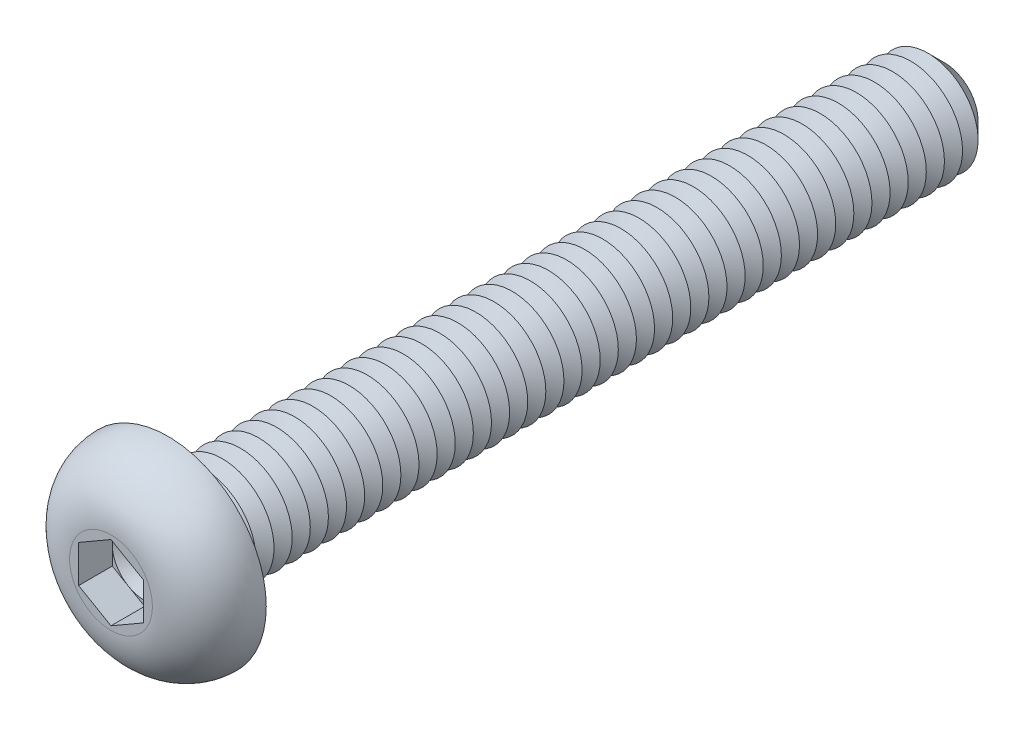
from build123d import *

# Parameters (mm, degrees)
CUT_EXTRUDE1_DEPTH  = 1.3
SKETCH4_R           = 2
BOSS_EXTRUDE1_DEPTH = 30
CHAMFER1_SIZE       = 0.7
LPATTERN1_COUNT     = 41
LPATTERN1_PITCH     = 0.7
FILLET2_R           = 0.3


with BuildPart() as part:
    # Sketch2 → Revolve1 (revolve)
    with BuildSketch(Plane(origin=(0, 0, 0), x_dir=(0, 0, -1), z_dir=(1, 0, 0)), mode=Mode.PRIVATE) as revolve1_sk:
        with BuildLine():
            Line((0, 0), (-2.2, 0))
            Line((-2.2, 0), (-2.2, 1.6))
            ThreePointArc((-2.2, 1.6), (-1.555634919, 3.155634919), (0, 3.8))
            Line((0, 3.8), (0, 0))
        make_face()
    revolve(revolve1_sk.sketch.rotate(Axis((0, 0, 47.934239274), (0, 0, -1)), 90), axis=Axis((0, 0, 47.934239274), (0, 0, -1)))

    # Sketch3 → Cut-Extrude1 (cut)
    with BuildSketch(Plane.XY.offset(2.2)):
        Polygon((0, 1.443375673), (-1.25, 0.721687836), (-1.25, -0.721687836), (0, -1.443375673), (1.25, -0.721687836), (1.25, 0.721687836), align=None)
    extrude(amount=-CUT_EXTRUDE1_DEPTH, mode=Mode.SUBTRACT)

    # Sketch4 → Boss-Extrude1 (add)
    with BuildSketch(Plane(origin=(0, 0, 0), x_dir=(-1, 0, 0), z_dir=(0, 0, -1))):
        with Locations(Location((0, 0, 0), (0, 0, 180))):
            Circle(SKETCH4_R)
    extrude(amount=BOSS_EXTRUDE1_DEPTH)

    # Chamfer1
    chamfer1_edges = [part.edges().sort_by_distance(p)[0] for p in [
        (-2, 0, -30),
    ]]
    chamfer(chamfer1_edges, length=CHAMFER1_SIZE)

    # Sketch5 → Cut-Revolve1 (revolve, cut)
    with BuildSketch(Plane(origin=(0, 0, 0), x_dir=(0, 0, -1), z_dir=(1, 0, 0)), mode=Mode.PRIVATE) as cut_revolve1_sk:
        Polygon((0.7, 2), (1.4, 2), (1.05, 1.393782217), align=None)
    cut_revolve1 = revolve(cut_revolve1_sk.sketch.rotate(Axis((0, 0, 47.934239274), (0, 0, -1)), 90), axis=Axis((0, 0, 47.934239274), (0, 0, -1)), mode=Mode.SUBTRACT)

    # LPattern1: Cut-Revolve1 ×41
    with Locations(*[(0, 0, -i * LPATTERN1_PITCH) for i in range(1, LPATTERN1_COUNT)]):
        add(cut_revolve1, mode=Mode.SUBTRACT)

    # Fillet2
    fillet2_edges = [part.edges().sort_by_distance(p)[0] for p in [
        (-2, 0, 0),
    ]]
    fillet(fillet2_edges, radius=FILLET2_R)

    # Cut-Extrude2 cone 1 section (on through the dimple's axis) → Cut-Extrude2 (revolve, cut)
    with BuildSketch(Plane(origin=(0, 0, 0.9), x_dir=(0, -1, 0), z_dir=(1, 0, 0))):
        Polygon((0, 0), (1.25, 0), (0, 0.721687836), align=None)
    revolve(axis=Axis((0, 0, 0.9), (0, 0, -1)), mode=Mode.SUBTRACT)


solid = part.part
